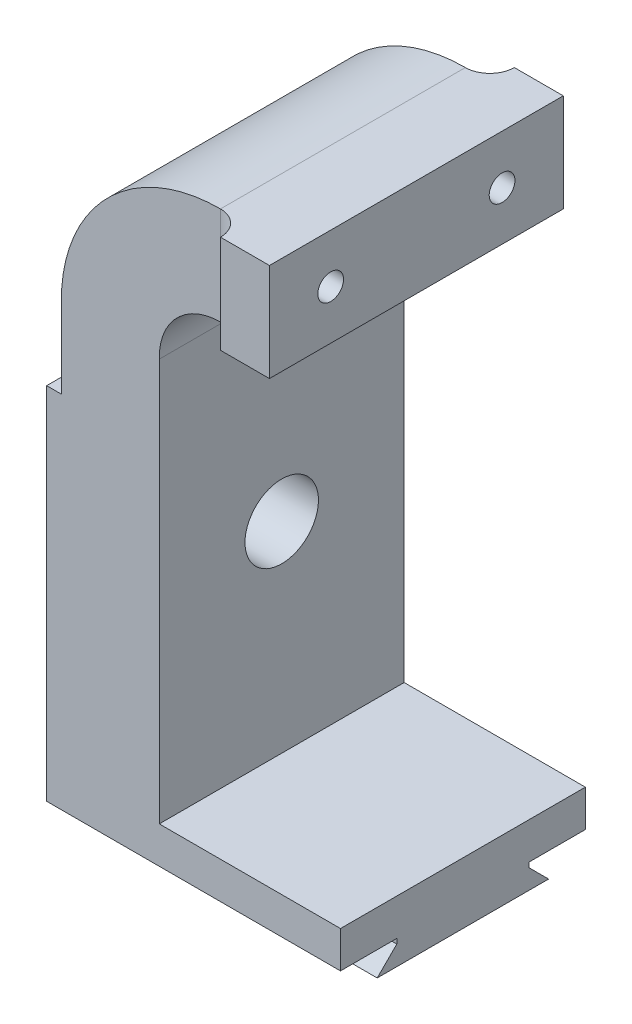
ISO-10303-21;
HEADER;
FILE_DESCRIPTION(('STEP AP214'),'2;1');
FILE_NAME('part.step','',(''),(''),'','','');
FILE_SCHEMA(('AUTOMOTIVE_DESIGN { 1 0 10303 214 1 1 1 1 }'));
ENDSEC;
DATA;
#1=APPLICATION_CONTEXT('core data for automotive mechanical design processes');
#2=APPLICATION_PROTOCOL_DEFINITION('international standard','automotive_design',2000,#1);
#3=PRODUCT_CONTEXT('',#1,'mechanical');
#4=PRODUCT('Part','Part','',(#3));
#5=PRODUCT_RELATED_PRODUCT_CATEGORY('part','',(#4));
#6=PRODUCT_DEFINITION_FORMATION('','',#4);
#7=PRODUCT_DEFINITION_CONTEXT('part definition',#1,'design');
#8=PRODUCT_DEFINITION('design','',#6,#7);
#9=PRODUCT_DEFINITION_SHAPE('','',#8);
#10=(LENGTH_UNIT() NAMED_UNIT(*) SI_UNIT(.MILLI.,.METRE.));
#11=(NAMED_UNIT(*) PLANE_ANGLE_UNIT() SI_UNIT($,.RADIAN.));
#12=(NAMED_UNIT(*) SI_UNIT($,.STERADIAN.) SOLID_ANGLE_UNIT());
#13=UNCERTAINTY_MEASURE_WITH_UNIT(LENGTH_MEASURE(1.E-05),#10,'distance_accuracy_value','');
#14=(GEOMETRIC_REPRESENTATION_CONTEXT(3) GLOBAL_UNCERTAINTY_ASSIGNED_CONTEXT((#13)) GLOBAL_UNIT_ASSIGNED_CONTEXT((#10,
#11,#12)) REPRESENTATION_CONTEXT('',''));
#15=CARTESIAN_POINT('',(0.,0.,0.));
#16=DIRECTION('',(0.,0.,1.));
#17=DIRECTION('',(1.,0.,0.));
#18=AXIS2_PLACEMENT_3D('',#15,#16,#17);
#19=CARTESIAN_POINT('',(-27.5,42.,-50.));
#20=DIRECTION('',(0.,0.,-1.));
#21=DIRECTION('',(-1.,0.,0.));
#22=AXIS2_PLACEMENT_3D('',#19,#20,#21);
#23=PLANE('',#22);
#24=CARTESIAN_POINT('',(-76.5076927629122,222.,-50.));
#25=DIRECTION('',(0.,0.,-1.));
#26=DIRECTION('',(-1.,0.,0.));
#27=AXIS2_PLACEMENT_3D('',#24,#25,#26);
#28=CIRCLE('',#27,65.0000000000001);
#29=CARTESIAN_POINT('',(-76.5076927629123,287.,-50.));
#30=VERTEX_POINT('',#29);
#31=CARTESIAN_POINT('',(-141.5,221.,-50.));
#32=VERTEX_POINT('',#31);
#33=EDGE_CURVE('E471',#30,#32,#28,.F.);
#34=ORIENTED_EDGE('',*,*,#33,.F.);
#35=DIRECTION('',(0.,-1.,0.));
#36=VECTOR('',#35,1.);
#37=CARTESIAN_POINT('',(-76.5076927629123,247.,-50.));
#38=LINE('',#37,#36);
#39=CARTESIAN_POINT('',(-76.5076927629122,247.,-50.));
#40=VERTEX_POINT('',#39);
#41=EDGE_CURVE('E214',#30,#40,#38,.T.);
#42=ORIENTED_EDGE('',*,*,#41,.T.);
#43=CARTESIAN_POINT('',(-76.5076927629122,222.,-50.));
#44=DIRECTION('',(0.,0.,-1.));
#45=DIRECTION('',(-1.,0.,0.));
#46=AXIS2_PLACEMENT_3D('',#43,#44,#45);
#47=CIRCLE('',#46,25.);
#48=CARTESIAN_POINT('',(-101.5,221.379855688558,-50.));
#49=VERTEX_POINT('',#48);
#50=EDGE_CURVE('E474',#49,#40,#47,.T.);
#51=ORIENTED_EDGE('',*,*,#50,.F.);
#52=DIRECTION('',(0.,1.,0.));
#53=VECTOR('',#52,1.);
#54=CARTESIAN_POINT('',(-101.5,221.379855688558,-50.));
#55=LINE('',#54,#53);
#56=CARTESIAN_POINT('',(-101.5,57.,-50.));
#57=VERTEX_POINT('',#56);
#58=EDGE_CURVE('E232',#57,#49,#55,.T.);
#59=ORIENTED_EDGE('',*,*,#58,.F.);
#60=DIRECTION('',(-1.,0.,0.));
#61=VECTOR('',#60,1.);
#62=CARTESIAN_POINT('',(-27.5,57.,-50.));
#63=LINE('',#62,#61);
#64=CARTESIAN_POINT('',(-27.5,57.,-50.));
#65=VERTEX_POINT('',#64);
#66=EDGE_CURVE('E154',#65,#57,#63,.T.);
#67=ORIENTED_EDGE('',*,*,#66,.F.);
#68=DIRECTION('',(0.,-1.,0.));
#69=VECTOR('',#68,1.);
#70=CARTESIAN_POINT('',(-27.5,42.,-50.));
#71=LINE('',#70,#69);
#72=CARTESIAN_POINT('',(-27.5,42.,-50.));
#73=VERTEX_POINT('',#72);
#74=EDGE_CURVE('E160',#65,#73,#71,.T.);
#75=ORIENTED_EDGE('',*,*,#74,.T.);
#76=DIRECTION('',(-1.,0.,0.));
#77=VECTOR('',#76,1.);
#78=CARTESIAN_POINT('',(-27.5,42.,-50.));
#79=LINE('',#78,#77);
#80=CARTESIAN_POINT('',(-147.5,42.,-50.));
#81=VERTEX_POINT('',#80);
#82=EDGE_CURVE('E141',#73,#81,#79,.T.);
#83=ORIENTED_EDGE('',*,*,#82,.T.);
#84=DIRECTION('',(0.,-1.,0.));
#85=VECTOR('',#84,1.);
#86=CARTESIAN_POINT('',(-147.5,42.,-50.));
#87=LINE('',#86,#85);
#88=CARTESIAN_POINT('',(-147.5,189.,-50.));
#89=VERTEX_POINT('',#88);
#90=EDGE_CURVE('E202',#89,#81,#87,.T.);
#91=ORIENTED_EDGE('',*,*,#90,.F.);
#92=DIRECTION('',(-1.,0.,0.));
#93=VECTOR('',#92,1.);
#94=CARTESIAN_POINT('',(-141.5,189.,-50.));
#95=LINE('',#94,#93);
#96=CARTESIAN_POINT('',(-141.5,189.,-50.));
#97=VERTEX_POINT('',#96);
#98=EDGE_CURVE('E269',#97,#89,#95,.T.);
#99=ORIENTED_EDGE('',*,*,#98,.F.);
#100=DIRECTION('',(0.,-1.,0.));
#101=VECTOR('',#100,1.);
#102=CARTESIAN_POINT('',(-141.5,221.,-50.));
#103=LINE('',#102,#101);
#104=EDGE_CURVE('E468',#32,#97,#103,.T.);
#105=ORIENTED_EDGE('',*,*,#104,.F.);
#106=EDGE_LOOP('',(#34,#42,#51,#59,#67,#75,#83,#91,#99,#105));
#107=FACE_BOUND('',#106,.T.);
#108=ADVANCED_FACE('F53',(#107),#23,.T.);
#109=CARTESIAN_POINT('',(-27.5,40.,-27.0000000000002));
#110=DIRECTION('',(0.,0.707106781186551,-0.707106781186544));
#111=DIRECTION('',(0.,0.707106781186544,0.707106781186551));
#112=AXIS2_PLACEMENT_3D('',#109,#110,#111);
#113=PLANE('',#112);
#114=DIRECTION('',(0.,-0.707106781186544,-0.707106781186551));
#115=VECTOR('',#114,1.);
#116=CARTESIAN_POINT('',(-147.5,40.,-27.0000000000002));
#117=LINE('',#116,#115);
#118=CARTESIAN_POINT('',(-147.5,40.,-27.0000000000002));
#119=VERTEX_POINT('',#118);
#120=CARTESIAN_POINT('',(-147.5,32.,-35.0000000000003));
#121=VERTEX_POINT('',#120);
#122=EDGE_CURVE('E177',#119,#121,#117,.T.);
#123=ORIENTED_EDGE('',*,*,#122,.F.);
#124=DIRECTION('',(-1.,0.,0.));
#125=VECTOR('',#124,1.);
#126=CARTESIAN_POINT('',(-27.5,40.,-27.0000000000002));
#127=LINE('',#126,#125);
#128=CARTESIAN_POINT('',(-27.5,40.,-27.0000000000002));
#129=VERTEX_POINT('',#128);
#130=EDGE_CURVE('E78',#129,#119,#127,.T.);
#131=ORIENTED_EDGE('',*,*,#130,.F.);
#132=DIRECTION('',(0.,-0.707106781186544,-0.707106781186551));
#133=VECTOR('',#132,1.);
#134=CARTESIAN_POINT('',(-27.5,40.,-27.0000000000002));
#135=LINE('',#134,#133);
#136=CARTESIAN_POINT('',(-27.5,32.,-35.0000000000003));
#137=VERTEX_POINT('',#136);
#138=EDGE_CURVE('E211',#129,#137,#135,.T.);
#139=ORIENTED_EDGE('',*,*,#138,.T.);
#140=DIRECTION('',(-1.,0.,0.));
#141=VECTOR('',#140,1.);
#142=CARTESIAN_POINT('',(-27.5,32.,-35.0000000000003));
#143=LINE('',#142,#141);
#144=EDGE_CURVE('E117',#137,#121,#143,.T.);
#145=ORIENTED_EDGE('',*,*,#144,.T.);
#146=EDGE_LOOP('',(#123,#131,#139,#145));
#147=FACE_BOUND('',#146,.T.);
#148=ADVANCED_FACE('F314',(#147),#113,.T.);
#149=CARTESIAN_POINT('',(-27.5,42.,-27.0000000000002));
#150=DIRECTION('',(0.,0.,-1.));
#151=DIRECTION('',(-1.,0.,0.));
#152=AXIS2_PLACEMENT_3D('',#149,#150,#151);
#153=PLANE('',#152);
#154=DIRECTION('',(0.,-1.,0.));
#155=VECTOR('',#154,1.);
#156=CARTESIAN_POINT('',(-147.5,42.,-27.0000000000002));
#157=LINE('',#156,#155);
#158=CARTESIAN_POINT('',(-147.5,42.,-27.0000000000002));
#159=VERTEX_POINT('',#158);
#160=EDGE_CURVE('E207',#159,#119,#157,.T.);
#161=ORIENTED_EDGE('',*,*,#160,.F.);
#162=DIRECTION('',(-1.,0.,0.));
#163=VECTOR('',#162,1.);
#164=CARTESIAN_POINT('',(-27.5,42.,-27.0000000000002));
#165=LINE('',#164,#163);
#166=CARTESIAN_POINT('',(-27.5,42.,-27.0000000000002));
#167=VERTEX_POINT('',#166);
#168=EDGE_CURVE('E153',#167,#159,#165,.T.);
#169=ORIENTED_EDGE('',*,*,#168,.F.);
#170=DIRECTION('',(0.,-1.,0.));
#171=VECTOR('',#170,1.);
#172=CARTESIAN_POINT('',(-27.5,42.,-27.0000000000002));
#173=LINE('',#172,#171);
#174=EDGE_CURVE('E162',#167,#129,#173,.T.);
#175=ORIENTED_EDGE('',*,*,#174,.T.);
#176=ORIENTED_EDGE('',*,*,#130,.T.);
#177=EDGE_LOOP('',(#161,#169,#175,#176));
#178=FACE_BOUND('',#177,.T.);
#179=ADVANCED_FACE('F319',(#178),#153,.T.);
#180=CARTESIAN_POINT('',(-27.5,42.,-27.0000000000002));
#181=DIRECTION('',(0.,-1.,0.));
#182=DIRECTION('',(0.,0.,-1.));
#183=AXIS2_PLACEMENT_3D('',#180,#181,#182);
#184=PLANE('',#183);
#185=DIRECTION('',(0.,0.,1.));
#186=VECTOR('',#185,1.);
#187=CARTESIAN_POINT('',(-147.5,42.,-27.0000000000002));
#188=LINE('',#187,#186);
#189=EDGE_CURVE('E147',#81,#159,#188,.T.);
#190=ORIENTED_EDGE('',*,*,#189,.F.);
#191=ORIENTED_EDGE('',*,*,#82,.F.);
#192=DIRECTION('',(0.,0.,1.));
#193=VECTOR('',#192,1.);
#194=CARTESIAN_POINT('',(-27.5,42.,-27.0000000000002));
#195=LINE('',#194,#193);
#196=EDGE_CURVE('E144',#73,#167,#195,.T.);
#197=ORIENTED_EDGE('',*,*,#196,.T.);
#198=ORIENTED_EDGE('',*,*,#168,.T.);
#199=EDGE_LOOP('',(#190,#191,#197,#198));
#200=FACE_BOUND('',#199,.T.);
#201=ADVANCED_FACE('F143',(#200),#184,.T.);
#202=CARTESIAN_POINT('',(-27.5,57.,-50.));
#203=DIRECTION('',(0.,1.,0.));
#204=DIRECTION('',(0.,0.,1.));
#205=AXIS2_PLACEMENT_3D('',#202,#203,#204);
#206=PLANE('',#205);
#207=DIRECTION('',(0.,0.,-1.));
#208=VECTOR('',#207,1.);
#209=CARTESIAN_POINT('',(-101.5,57.,301.196031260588));
#210=LINE('',#209,#208);
#211=CARTESIAN_POINT('',(-101.5,57.,50.));
#212=VERTEX_POINT('',#211);
#213=EDGE_CURVE('E69',#212,#57,#210,.T.);
#214=ORIENTED_EDGE('',*,*,#213,.F.);
#215=DIRECTION('',(-1.,0.,0.));
#216=VECTOR('',#215,1.);
#217=CARTESIAN_POINT('',(-27.5,57.,50.));
#218=LINE('',#217,#216);
#219=CARTESIAN_POINT('',(-27.5,57.,50.));
#220=VERTEX_POINT('',#219);
#221=EDGE_CURVE('E225',#220,#212,#218,.T.);
#222=ORIENTED_EDGE('',*,*,#221,.F.);
#223=DIRECTION('',(0.,0.,-1.));
#224=VECTOR('',#223,1.);
#225=CARTESIAN_POINT('',(-27.5,57.,-50.));
#226=LINE('',#225,#224);
#227=EDGE_CURVE('E168',#220,#65,#226,.T.);
#228=ORIENTED_EDGE('',*,*,#227,.T.);
#229=ORIENTED_EDGE('',*,*,#66,.T.);
#230=EDGE_LOOP('',(#214,#222,#228,#229));
#231=FACE_BOUND('',#230,.T.);
#232=ADVANCED_FACE('F326',(#231),#206,.T.);
#233=CARTESIAN_POINT('',(-27.5,57.,50.));
#234=DIRECTION('',(0.,0.,1.));
#235=DIRECTION('',(1.,0.,0.));
#236=AXIS2_PLACEMENT_3D('',#233,#234,#235);
#237=PLANE('',#236);
#238=CARTESIAN_POINT('',(-76.5076927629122,222.,50.));
#239=DIRECTION('',(0.,0.,1.));
#240=DIRECTION('',(1.,0.,0.));
#241=AXIS2_PLACEMENT_3D('',#238,#239,#240);
#242=CIRCLE('',#241,25.);
#243=CARTESIAN_POINT('',(-101.5,221.379855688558,50.));
#244=VERTEX_POINT('',#243);
#245=CARTESIAN_POINT('',(-76.5076927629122,247.,50.));
#246=VERTEX_POINT('',#245);
#247=EDGE_CURVE('E399',#244,#246,#242,.F.);
#248=ORIENTED_EDGE('',*,*,#247,.T.);
#249=DIRECTION('',(0.,-1.,0.));
#250=VECTOR('',#249,1.);
#251=CARTESIAN_POINT('',(-76.5076927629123,57.,50.));
#252=LINE('',#251,#250);
#253=CARTESIAN_POINT('',(-76.5076927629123,287.,50.));
#254=VERTEX_POINT('',#253);
#255=EDGE_CURVE('E387',#246,#254,#252,.F.);
#256=ORIENTED_EDGE('',*,*,#255,.T.);
#257=CARTESIAN_POINT('',(-76.5076927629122,222.,50.));
#258=DIRECTION('',(0.,0.,1.));
#259=DIRECTION('',(1.,0.,0.));
#260=AXIS2_PLACEMENT_3D('',#257,#258,#259);
#261=CIRCLE('',#260,65.0000000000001);
#262=CARTESIAN_POINT('',(-141.5,221.,50.));
#263=VERTEX_POINT('',#262);
#264=EDGE_CURVE('E404',#254,#263,#261,.T.);
#265=ORIENTED_EDGE('',*,*,#264,.T.);
#266=DIRECTION('',(0.,-1.,0.));
#267=VECTOR('',#266,1.);
#268=CARTESIAN_POINT('',(-141.5,221.,50.));
#269=LINE('',#268,#267);
#270=CARTESIAN_POINT('',(-141.5,189.,50.));
#271=VERTEX_POINT('',#270);
#272=EDGE_CURVE('E182',#263,#271,#269,.T.);
#273=ORIENTED_EDGE('',*,*,#272,.T.);
#274=DIRECTION('',(-1.,0.,0.));
#275=VECTOR('',#274,1.);
#276=CARTESIAN_POINT('',(-141.5,189.,50.));
#277=LINE('',#276,#275);
#278=CARTESIAN_POINT('',(-147.5,189.,50.));
#279=VERTEX_POINT('',#278);
#280=EDGE_CURVE('E237',#271,#279,#277,.T.);
#281=ORIENTED_EDGE('',*,*,#280,.T.);
#282=DIRECTION('',(0.,1.,0.));
#283=VECTOR('',#282,1.);
#284=CARTESIAN_POINT('',(-147.5,57.,50.));
#285=LINE('',#284,#283);
#286=CARTESIAN_POINT('',(-147.5,42.,50.));
#287=VERTEX_POINT('',#286);
#288=EDGE_CURVE('E198',#287,#279,#285,.T.);
#289=ORIENTED_EDGE('',*,*,#288,.F.);
#290=DIRECTION('',(-1.,0.,0.));
#291=VECTOR('',#290,1.);
#292=CARTESIAN_POINT('',(-27.5,42.,50.));
#293=LINE('',#292,#291);
#294=CARTESIAN_POINT('',(-27.5,42.,50.));
#295=VERTEX_POINT('',#294);
#296=EDGE_CURVE('E295',#295,#287,#293,.T.);
#297=ORIENTED_EDGE('',*,*,#296,.F.);
#298=DIRECTION('',(0.,1.,0.));
#299=VECTOR('',#298,1.);
#300=CARTESIAN_POINT('',(-27.5,57.,50.));
#301=LINE('',#300,#299);
#302=EDGE_CURVE('E171',#295,#220,#301,.T.);
#303=ORIENTED_EDGE('',*,*,#302,.T.);
#304=ORIENTED_EDGE('',*,*,#221,.T.);
#305=DIRECTION('',(0.,1.,0.));
#306=VECTOR('',#305,1.);
#307=CARTESIAN_POINT('',(-101.5,221.379855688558,50.));
#308=LINE('',#307,#306);
#309=EDGE_CURVE('E397',#212,#244,#308,.T.);
#310=ORIENTED_EDGE('',*,*,#309,.T.);
#311=EDGE_LOOP('',(#248,#256,#265,#273,#281,#289,#297,#303,#304,#310));
#312=FACE_BOUND('',#311,.T.);
#313=ADVANCED_FACE('F291',(#312),#237,.T.);
#314=CARTESIAN_POINT('',(-27.5,42.,50.));
#315=DIRECTION('',(0.,-1.,0.));
#316=DIRECTION('',(0.,0.,-1.));
#317=AXIS2_PLACEMENT_3D('',#314,#315,#316);
#318=PLANE('',#317);
#319=DIRECTION('',(0.,0.,1.));
#320=VECTOR('',#319,1.);
#321=CARTESIAN_POINT('',(-147.5,42.,50.));
#322=LINE('',#321,#320);
#323=CARTESIAN_POINT('',(-147.5,42.,27.0000000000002));
#324=VERTEX_POINT('',#323);
#325=EDGE_CURVE('E194',#324,#287,#322,.T.);
#326=ORIENTED_EDGE('',*,*,#325,.F.);
#327=DIRECTION('',(-1.,0.,0.));
#328=VECTOR('',#327,1.);
#329=CARTESIAN_POINT('',(-27.5,42.,27.0000000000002));
#330=LINE('',#329,#328);
#331=CARTESIAN_POINT('',(-27.5,42.,27.0000000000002));
#332=VERTEX_POINT('',#331);
#333=EDGE_CURVE('E301',#332,#324,#330,.T.);
#334=ORIENTED_EDGE('',*,*,#333,.F.);
#335=DIRECTION('',(0.,0.,1.));
#336=VECTOR('',#335,1.);
#337=CARTESIAN_POINT('',(-27.5,42.,50.));
#338=LINE('',#337,#336);
#339=EDGE_CURVE('E283',#332,#295,#338,.T.);
#340=ORIENTED_EDGE('',*,*,#339,.T.);
#341=ORIENTED_EDGE('',*,*,#296,.T.);
#342=EDGE_LOOP('',(#326,#334,#340,#341));
#343=FACE_BOUND('',#342,.T.);
#344=ADVANCED_FACE('F300',(#343),#318,.T.);
#345=CARTESIAN_POINT('',(-27.5,40.,27.0000000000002));
#346=DIRECTION('',(0.,0.,1.));
#347=DIRECTION('',(0.,-1.,0.));
#348=AXIS2_PLACEMENT_3D('',#345,#346,#347);
#349=PLANE('',#348);
#350=DIRECTION('',(0.,1.,0.));
#351=VECTOR('',#350,1.);
#352=CARTESIAN_POINT('',(-147.5,40.,27.0000000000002));
#353=LINE('',#352,#351);
#354=CARTESIAN_POINT('',(-147.5,40.,27.0000000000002));
#355=VERTEX_POINT('',#354);
#356=EDGE_CURVE('E190',#355,#324,#353,.T.);
#357=ORIENTED_EDGE('',*,*,#356,.F.);
#358=DIRECTION('',(-1.,0.,0.));
#359=VECTOR('',#358,1.);
#360=CARTESIAN_POINT('',(-27.5,40.,27.0000000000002));
#361=LINE('',#360,#359);
#362=CARTESIAN_POINT('',(-27.5,40.,27.0000000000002));
#363=VERTEX_POINT('',#362);
#364=EDGE_CURVE('E305',#363,#355,#361,.T.);
#365=ORIENTED_EDGE('',*,*,#364,.F.);
#366=DIRECTION('',(0.,1.,0.));
#367=VECTOR('',#366,1.);
#368=CARTESIAN_POINT('',(-27.5,40.,27.0000000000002));
#369=LINE('',#368,#367);
#370=EDGE_CURVE('E279',#363,#332,#369,.T.);
#371=ORIENTED_EDGE('',*,*,#370,.T.);
#372=ORIENTED_EDGE('',*,*,#333,.T.);
#373=EDGE_LOOP('',(#357,#365,#371,#372));
#374=FACE_BOUND('',#373,.T.);
#375=ADVANCED_FACE('F342',(#374),#349,.T.);
#376=CARTESIAN_POINT('',(-27.5,32.,35.0000000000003));
#377=DIRECTION('',(0.,0.707106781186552,0.707106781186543));
#378=DIRECTION('',(0.,-0.707106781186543,0.707106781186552));
#379=AXIS2_PLACEMENT_3D('',#376,#377,#378);
#380=PLANE('',#379);
#381=DIRECTION('',(0.,0.707106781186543,-0.707106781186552));
#382=VECTOR('',#381,1.);
#383=CARTESIAN_POINT('',(-147.5,32.,35.0000000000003));
#384=LINE('',#383,#382);
#385=CARTESIAN_POINT('',(-147.5,32.,35.0000000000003));
#386=VERTEX_POINT('',#385);
#387=EDGE_CURVE('E186',#386,#355,#384,.T.);
#388=ORIENTED_EDGE('',*,*,#387,.F.);
#389=DIRECTION('',(-1.,0.,0.));
#390=VECTOR('',#389,1.);
#391=CARTESIAN_POINT('',(-27.5,32.,35.0000000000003));
#392=LINE('',#391,#390);
#393=CARTESIAN_POINT('',(-27.5,32.,35.0000000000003));
#394=VERTEX_POINT('',#393);
#395=EDGE_CURVE('E309',#394,#386,#392,.T.);
#396=ORIENTED_EDGE('',*,*,#395,.F.);
#397=DIRECTION('',(0.,0.707106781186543,-0.707106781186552));
#398=VECTOR('',#397,1.);
#399=CARTESIAN_POINT('',(-27.5,32.,35.0000000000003));
#400=LINE('',#399,#398);
#401=EDGE_CURVE('E275',#394,#363,#400,.T.);
#402=ORIENTED_EDGE('',*,*,#401,.T.);
#403=ORIENTED_EDGE('',*,*,#364,.T.);
#404=EDGE_LOOP('',(#388,#396,#402,#403));
#405=FACE_BOUND('',#404,.T.);
#406=ADVANCED_FACE('F345',(#405),#380,.T.);
#407=CARTESIAN_POINT('',(-27.5,32.,-35.0000000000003));
#408=DIRECTION('',(0.,-1.,0.));
#409=DIRECTION('',(0.,0.,-1.));
#410=AXIS2_PLACEMENT_3D('',#407,#408,#409);
#411=PLANE('',#410);
#412=DIRECTION('',(0.,0.,1.));
#413=VECTOR('',#412,1.);
#414=CARTESIAN_POINT('',(-147.5,32.,-35.0000000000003));
#415=LINE('',#414,#413);
#416=EDGE_CURVE('E181',#121,#386,#415,.T.);
#417=ORIENTED_EDGE('',*,*,#416,.F.);
#418=ORIENTED_EDGE('',*,*,#144,.F.);
#419=DIRECTION('',(0.,0.,1.));
#420=VECTOR('',#419,1.);
#421=CARTESIAN_POINT('',(-27.5,32.,-35.0000000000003));
#422=LINE('',#421,#420);
#423=EDGE_CURVE('E272',#137,#394,#422,.T.);
#424=ORIENTED_EDGE('',*,*,#423,.T.);
#425=ORIENTED_EDGE('',*,*,#395,.T.);
#426=EDGE_LOOP('',(#417,#418,#424,#425));
#427=FACE_BOUND('',#426,.T.);
#428=ADVANCED_FACE('F315',(#427),#411,.T.);
#429=CARTESIAN_POINT('',(-27.5,0.,0.));
#430=DIRECTION('',(1.,0.,0.));
#431=DIRECTION('',(0.,0.,-1.));
#432=AXIS2_PLACEMENT_3D('',#429,#430,#431);
#433=PLANE('',#432);
#434=ORIENTED_EDGE('',*,*,#138,.F.);
#435=ORIENTED_EDGE('',*,*,#174,.F.);
#436=ORIENTED_EDGE('',*,*,#196,.F.);
#437=ORIENTED_EDGE('',*,*,#74,.F.);
#438=ORIENTED_EDGE('',*,*,#227,.F.);
#439=ORIENTED_EDGE('',*,*,#302,.F.);
#440=ORIENTED_EDGE('',*,*,#339,.F.);
#441=ORIENTED_EDGE('',*,*,#370,.F.);
#442=ORIENTED_EDGE('',*,*,#401,.F.);
#443=ORIENTED_EDGE('',*,*,#423,.F.);
#444=EDGE_LOOP('',(#434,#435,#436,#437,#438,#439,#440,#441,#442,#443));
#445=FACE_BOUND('',#444,.T.);
#446=ADVANCED_FACE('F158',(#445),#433,.T.);
#447=CARTESIAN_POINT('',(-147.5,0.,0.));
#448=DIRECTION('',(1.,0.,0.));
#449=DIRECTION('',(0.,0.,-1.));
#450=AXIS2_PLACEMENT_3D('',#447,#448,#449);
#451=PLANE('',#450);
#452=CARTESIAN_POINT('',(-147.5,139.,0.));
#453=DIRECTION('',(1.,0.,0.));
#454=DIRECTION('',(0.,1.,0.));
#455=AXIS2_PLACEMENT_3D('',#452,#453,#454);
#456=CIRCLE('',#455,15.);
#457=CARTESIAN_POINT('',(-147.5,154.,0.));
#458=VERTEX_POINT('',#457);
#459=EDGE_CURVE('E523',#458,#458,#456,.T.);
#460=ORIENTED_EDGE('',*,*,#459,.T.);
#461=EDGE_LOOP('',(#460));
#462=FACE_BOUND('',#461,.T.);
#463=ORIENTED_EDGE('',*,*,#122,.T.);
#464=ORIENTED_EDGE('',*,*,#416,.T.);
#465=ORIENTED_EDGE('',*,*,#387,.T.);
#466=ORIENTED_EDGE('',*,*,#356,.T.);
#467=ORIENTED_EDGE('',*,*,#325,.T.);
#468=ORIENTED_EDGE('',*,*,#288,.T.);
#469=DIRECTION('',(0.,0.,-1.));
#470=VECTOR('',#469,1.);
#471=CARTESIAN_POINT('',(-147.5,189.,301.196031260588));
#472=LINE('',#471,#470);
#473=EDGE_CURVE('E231',#279,#89,#472,.T.);
#474=ORIENTED_EDGE('',*,*,#473,.T.);
#475=ORIENTED_EDGE('',*,*,#90,.T.);
#476=ORIENTED_EDGE('',*,*,#189,.T.);
#477=ORIENTED_EDGE('',*,*,#160,.T.);
#478=EDGE_LOOP('',(#463,#464,#465,#466,#467,#468,#474,#475,#476,#477));
#479=FACE_BOUND('',#478,.T.);
#480=ADVANCED_FACE('F318',(#462,#479),#451,.F.);
#481=CARTESIAN_POINT('',(-101.5,221.379855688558,301.196031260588));
#482=DIRECTION('',(-1.,0.,0.));
#483=DIRECTION('',(0.,-1.,0.));
#484=AXIS2_PLACEMENT_3D('',#481,#482,#483);
#485=PLANE('',#484);
#486=CARTESIAN_POINT('',(-101.5,139.,0.));
#487=DIRECTION('',(1.,0.,0.));
#488=DIRECTION('',(0.,1.,0.));
#489=AXIS2_PLACEMENT_3D('',#486,#487,#488);
#490=CIRCLE('',#489,15.);
#491=CARTESIAN_POINT('',(-101.5,154.,0.));
#492=VERTEX_POINT('',#491);
#493=EDGE_CURVE('E527',#492,#492,#490,.T.);
#494=ORIENTED_EDGE('',*,*,#493,.F.);
#495=EDGE_LOOP('',(#494));
#496=FACE_BOUND('',#495,.T.);
#497=ORIENTED_EDGE('',*,*,#309,.F.);
#498=ORIENTED_EDGE('',*,*,#213,.T.);
#499=ORIENTED_EDGE('',*,*,#58,.T.);
#500=DIRECTION('',(0.,0.,-1.));
#501=VECTOR('',#500,1.);
#502=CARTESIAN_POINT('',(-101.5,221.379855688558,301.196031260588));
#503=LINE('',#502,#501);
#504=EDGE_CURVE('E230',#244,#49,#503,.T.);
#505=ORIENTED_EDGE('',*,*,#504,.F.);
#506=EDGE_LOOP('',(#497,#498,#499,#505));
#507=FACE_BOUND('',#506,.T.);
#508=ADVANCED_FACE('F487',(#496,#507),#485,.F.);
#509=CARTESIAN_POINT('',(-76.5076927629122,222.,301.196031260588));
#510=DIRECTION('',(0.,0.,-1.));
#511=DIRECTION('',(-1.,0.,0.));
#512=AXIS2_PLACEMENT_3D('',#509,#510,#511);
#513=CYLINDRICAL_SURFACE('',#512,25.);
#514=ORIENTED_EDGE('',*,*,#247,.F.);
#515=ORIENTED_EDGE('',*,*,#504,.T.);
#516=ORIENTED_EDGE('',*,*,#50,.T.);
#517=DIRECTION('',(0.,0.,-1.));
#518=VECTOR('',#517,1.);
#519=CARTESIAN_POINT('',(-76.5076927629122,247.,301.196031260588));
#520=LINE('',#519,#518);
#521=EDGE_CURVE('E242',#246,#40,#520,.T.);
#522=ORIENTED_EDGE('',*,*,#521,.F.);
#523=EDGE_LOOP('',(#514,#515,#516,#522));
#524=FACE_BOUND('',#523,.T.);
#525=ADVANCED_FACE('F503',(#524),#513,.F.);
#526=CARTESIAN_POINT('',(-46.5076927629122,247.,301.196031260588));
#527=DIRECTION('',(0.,1.,0.));
#528=DIRECTION('',(-1.,0.,0.));
#529=AXIS2_PLACEMENT_3D('',#526,#527,#528);
#530=PLANE('',#529);
#531=DIRECTION('',(1.,0.,0.));
#532=VECTOR('',#531,1.);
#533=CARTESIAN_POINT('',(-46.5076927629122,247.,60.));
#534=LINE('',#533,#532);
#535=CARTESIAN_POINT('',(-66.5076927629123,247.,60.));
#536=VERTEX_POINT('',#535);
#537=CARTESIAN_POINT('',(-46.5076927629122,247.,60.));
#538=VERTEX_POINT('',#537);
#539=EDGE_CURVE('E456',#536,#538,#534,.T.);
#540=ORIENTED_EDGE('',*,*,#539,.F.);
#541=CARTESIAN_POINT('',(-76.5076927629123,247.,60.));
#542=DIRECTION('',(0.,1.,0.));
#543=DIRECTION('',(-1.,0.,0.));
#544=AXIS2_PLACEMENT_3D('',#541,#542,#543);
#545=CIRCLE('',#544,10.);
#546=EDGE_CURVE('E62',#536,#246,#545,.T.);
#547=ORIENTED_EDGE('',*,*,#546,.T.);
#548=ORIENTED_EDGE('',*,*,#521,.T.);
#549=CARTESIAN_POINT('',(-76.5076927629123,247.,-60.));
#550=DIRECTION('',(0.,1.,0.));
#551=DIRECTION('',(-1.,0.,0.));
#552=AXIS2_PLACEMENT_3D('',#549,#550,#551);
#553=CIRCLE('',#552,10.);
#554=CARTESIAN_POINT('',(-66.5076927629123,247.,-60.));
#555=VERTEX_POINT('',#554);
#556=EDGE_CURVE('E381',#40,#555,#553,.T.);
#557=ORIENTED_EDGE('',*,*,#556,.T.);
#558=DIRECTION('',(1.,0.,0.));
#559=VECTOR('',#558,1.);
#560=CARTESIAN_POINT('',(-46.5076927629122,247.,-60.));
#561=LINE('',#560,#559);
#562=CARTESIAN_POINT('',(-46.5076927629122,247.,-60.));
#563=VERTEX_POINT('',#562);
#564=EDGE_CURVE('E532',#555,#563,#561,.T.);
#565=ORIENTED_EDGE('',*,*,#564,.T.);
#566=DIRECTION('',(0.,0.,-1.));
#567=VECTOR('',#566,1.);
#568=CARTESIAN_POINT('',(-46.5076927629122,247.,301.196031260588));
#569=LINE('',#568,#567);
#570=EDGE_CURVE('E246',#538,#563,#569,.T.);
#571=ORIENTED_EDGE('',*,*,#570,.F.);
#572=EDGE_LOOP('',(#540,#547,#548,#557,#565,#571));
#573=FACE_BOUND('',#572,.T.);
#574=ADVANCED_FACE('F502',(#573),#530,.F.);
#575=CARTESIAN_POINT('',(-46.5076927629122,287.,301.196031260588));
#576=DIRECTION('',(-1.,0.,0.));
#577=DIRECTION('',(0.,-1.,0.));
#578=AXIS2_PLACEMENT_3D('',#575,#576,#577);
#579=PLANE('',#578);
#580=CARTESIAN_POINT('',(-46.5076927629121,267.,35.));
#581=DIRECTION('',(1.,0.,0.));
#582=DIRECTION('',(0.,0.,-1.));
#583=AXIS2_PLACEMENT_3D('',#580,#581,#582);
#584=CIRCLE('',#583,5.24999999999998);
#585=CARTESIAN_POINT('',(-46.5076927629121,267.,29.75));
#586=VERTEX_POINT('',#585);
#587=EDGE_CURVE('E577',#586,#586,#584,.T.);
#588=ORIENTED_EDGE('',*,*,#587,.F.);
#589=EDGE_LOOP('',(#588));
#590=FACE_BOUND('',#589,.T.);
#591=CARTESIAN_POINT('',(-46.5076927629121,267.,-35.));
#592=DIRECTION('',(1.,0.,0.));
#593=DIRECTION('',(0.,0.,-1.));
#594=AXIS2_PLACEMENT_3D('',#591,#592,#593);
#595=CIRCLE('',#594,5.24999999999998);
#596=CARTESIAN_POINT('',(-46.5076927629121,267.,-40.25));
#597=VERTEX_POINT('',#596);
#598=EDGE_CURVE('E576',#597,#597,#595,.T.);
#599=ORIENTED_EDGE('',*,*,#598,.F.);
#600=EDGE_LOOP('',(#599));
#601=FACE_BOUND('',#600,.T.);
#602=DIRECTION('',(0.,0.,-1.));
#603=VECTOR('',#602,1.);
#604=CARTESIAN_POINT('',(-46.5076927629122,287.,301.196031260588));
#605=LINE('',#604,#603);
#606=CARTESIAN_POINT('',(-46.5076927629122,287.,60.));
#607=VERTEX_POINT('',#606);
#608=CARTESIAN_POINT('',(-46.5076927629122,287.,-60.));
#609=VERTEX_POINT('',#608);
#610=EDGE_CURVE('E250',#607,#609,#605,.T.);
#611=ORIENTED_EDGE('',*,*,#610,.F.);
#612=DIRECTION('',(0.,1.,0.));
#613=VECTOR('',#612,1.);
#614=CARTESIAN_POINT('',(-46.5076927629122,287.,60.));
#615=LINE('',#614,#613);
#616=EDGE_CURVE('E462',#538,#607,#615,.T.);
#617=ORIENTED_EDGE('',*,*,#616,.F.);
#618=ORIENTED_EDGE('',*,*,#570,.T.);
#619=DIRECTION('',(0.,1.,0.));
#620=VECTOR('',#619,1.);
#621=CARTESIAN_POINT('',(-46.5076927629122,287.,-60.));
#622=LINE('',#621,#620);
#623=EDGE_CURVE('E526',#563,#609,#622,.T.);
#624=ORIENTED_EDGE('',*,*,#623,.T.);
#625=EDGE_LOOP('',(#611,#617,#618,#624));
#626=FACE_BOUND('',#625,.T.);
#627=ADVANCED_FACE('F509',(#590,#601,#626),#579,.F.);
#628=CARTESIAN_POINT('',(-76.5076927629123,287.,301.196031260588));
#629=DIRECTION('',(0.,-1.,0.));
#630=DIRECTION('',(0.,0.,-1.));
#631=AXIS2_PLACEMENT_3D('',#628,#629,#630);
#632=PLANE('',#631);
#633=DIRECTION('',(0.,0.,-1.));
#634=VECTOR('',#633,1.);
#635=CARTESIAN_POINT('',(-76.5076927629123,287.,301.196031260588));
#636=LINE('',#635,#634);
#637=EDGE_CURVE('E254',#254,#30,#636,.T.);
#638=ORIENTED_EDGE('',*,*,#637,.F.);
#639=CARTESIAN_POINT('',(-76.5076927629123,287.,60.));
#640=DIRECTION('',(0.,-1.,0.));
#641=DIRECTION('',(0.,0.,-1.));
#642=AXIS2_PLACEMENT_3D('',#639,#640,#641);
#643=CIRCLE('',#642,10.);
#644=CARTESIAN_POINT('',(-66.5076927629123,287.,60.));
#645=VERTEX_POINT('',#644);
#646=EDGE_CURVE('E11',#254,#645,#643,.T.);
#647=ORIENTED_EDGE('',*,*,#646,.T.);
#648=DIRECTION('',(-1.,0.,0.));
#649=VECTOR('',#648,1.);
#650=CARTESIAN_POINT('',(-46.5076927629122,287.,60.));
#651=LINE('',#650,#649);
#652=EDGE_CURVE('E457',#607,#645,#651,.T.);
#653=ORIENTED_EDGE('',*,*,#652,.F.);
#654=ORIENTED_EDGE('',*,*,#610,.T.);
#655=DIRECTION('',(-1.,0.,0.));
#656=VECTOR('',#655,1.);
#657=CARTESIAN_POINT('',(-46.5076927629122,287.,-60.));
#658=LINE('',#657,#656);
#659=CARTESIAN_POINT('',(-66.5076927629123,287.,-60.));
#660=VERTEX_POINT('',#659);
#661=EDGE_CURVE('E544',#609,#660,#658,.T.);
#662=ORIENTED_EDGE('',*,*,#661,.T.);
#663=CARTESIAN_POINT('',(-76.5076927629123,287.,-60.));
#664=DIRECTION('',(0.,-1.,0.));
#665=DIRECTION('',(0.,0.,-1.));
#666=AXIS2_PLACEMENT_3D('',#663,#664,#665);
#667=CIRCLE('',#666,10.);
#668=EDGE_CURVE('E368',#660,#30,#667,.T.);
#669=ORIENTED_EDGE('',*,*,#668,.T.);
#670=EDGE_LOOP('',(#638,#647,#653,#654,#662,#669));
#671=FACE_BOUND('',#670,.T.);
#672=ADVANCED_FACE('F442',(#671),#632,.F.);
#673=CARTESIAN_POINT('',(-76.5076927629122,222.,301.196031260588));
#674=DIRECTION('',(0.,0.,-1.));
#675=DIRECTION('',(-1.,0.,0.));
#676=AXIS2_PLACEMENT_3D('',#673,#674,#675);
#677=CYLINDRICAL_SURFACE('',#676,65.0000000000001);
#678=ORIENTED_EDGE('',*,*,#264,.F.);
#679=ORIENTED_EDGE('',*,*,#637,.T.);
#680=ORIENTED_EDGE('',*,*,#33,.T.);
#681=DIRECTION('',(0.,0.,-1.));
#682=VECTOR('',#681,1.);
#683=CARTESIAN_POINT('',(-141.5,221.,301.196031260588));
#684=LINE('',#683,#682);
#685=EDGE_CURVE('E258',#263,#32,#684,.T.);
#686=ORIENTED_EDGE('',*,*,#685,.F.);
#687=EDGE_LOOP('',(#678,#679,#680,#686));
#688=FACE_BOUND('',#687,.T.);
#689=ADVANCED_FACE('F438',(#688),#677,.T.);
#690=CARTESIAN_POINT('',(-141.5,221.,301.196031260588));
#691=DIRECTION('',(1.,0.,0.));
#692=DIRECTION('',(0.,0.,-1.));
#693=AXIS2_PLACEMENT_3D('',#690,#691,#692);
#694=PLANE('',#693);
#695=ORIENTED_EDGE('',*,*,#272,.F.);
#696=ORIENTED_EDGE('',*,*,#685,.T.);
#697=ORIENTED_EDGE('',*,*,#104,.T.);
#698=DIRECTION('',(0.,0.,-1.));
#699=VECTOR('',#698,1.);
#700=CARTESIAN_POINT('',(-141.5,189.,301.196031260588));
#701=LINE('',#700,#699);
#702=EDGE_CURVE('E262',#271,#97,#701,.T.);
#703=ORIENTED_EDGE('',*,*,#702,.F.);
#704=EDGE_LOOP('',(#695,#696,#697,#703));
#705=FACE_BOUND('',#704,.T.);
#706=ADVANCED_FACE('F609',(#705),#694,.F.);
#707=CARTESIAN_POINT('',(-141.5,189.,301.196031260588));
#708=DIRECTION('',(0.,-1.,0.));
#709=DIRECTION('',(0.,0.,-1.));
#710=AXIS2_PLACEMENT_3D('',#707,#708,#709);
#711=PLANE('',#710);
#712=ORIENTED_EDGE('',*,*,#280,.F.);
#713=ORIENTED_EDGE('',*,*,#702,.T.);
#714=ORIENTED_EDGE('',*,*,#98,.T.);
#715=ORIENTED_EDGE('',*,*,#473,.F.);
#716=EDGE_LOOP('',(#712,#713,#714,#715));
#717=FACE_BOUND('',#716,.T.);
#718=ADVANCED_FACE('F413',(#717),#711,.F.);
#719=CARTESIAN_POINT('',(0.,0.,60.));
#720=DIRECTION('',(0.,0.,-1.));
#721=DIRECTION('',(-1.,0.,0.));
#722=AXIS2_PLACEMENT_3D('',#719,#720,#721);
#723=PLANE('',#722);
#724=ORIENTED_EDGE('',*,*,#616,.T.);
#725=ORIENTED_EDGE('',*,*,#652,.T.);
#726=DIRECTION('',(0.,-1.,0.));
#727=VECTOR('',#726,1.);
#728=CARTESIAN_POINT('',(-66.5076927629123,287.,60.));
#729=LINE('',#728,#727);
#730=EDGE_CURVE('E448',#645,#536,#729,.T.);
#731=ORIENTED_EDGE('',*,*,#730,.T.);
#732=ORIENTED_EDGE('',*,*,#539,.T.);
#733=EDGE_LOOP('',(#724,#725,#731,#732));
#734=FACE_BOUND('',#733,.T.);
#735=ADVANCED_FACE('F360',(#734),#723,.F.);
#736=CARTESIAN_POINT('',(0.,0.,-60.));
#737=DIRECTION('',(0.,0.,1.));
#738=DIRECTION('',(-1.,0.,0.));
#739=AXIS2_PLACEMENT_3D('',#736,#737,#738);
#740=PLANE('',#739);
#741=ORIENTED_EDGE('',*,*,#623,.F.);
#742=ORIENTED_EDGE('',*,*,#564,.F.);
#743=DIRECTION('',(0.,-1.,0.));
#744=VECTOR('',#743,1.);
#745=CARTESIAN_POINT('',(-66.5076927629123,287.,-60.));
#746=LINE('',#745,#744);
#747=EDGE_CURVE('E372',#660,#555,#746,.T.);
#748=ORIENTED_EDGE('',*,*,#747,.F.);
#749=ORIENTED_EDGE('',*,*,#661,.F.);
#750=EDGE_LOOP('',(#741,#742,#748,#749));
#751=FACE_BOUND('',#750,.T.);
#752=ADVANCED_FACE('F352',(#751),#740,.F.);
#753=CARTESIAN_POINT('',(-76.5076927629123,42.,-60.));
#754=DIRECTION('',(0.,1.,0.));
#755=DIRECTION('',(0.,0.,1.));
#756=AXIS2_PLACEMENT_3D('',#753,#754,#755);
#757=CYLINDRICAL_SURFACE('',#756,10.);
#758=ORIENTED_EDGE('',*,*,#668,.F.);
#759=ORIENTED_EDGE('',*,*,#747,.T.);
#760=ORIENTED_EDGE('',*,*,#556,.F.);
#761=ORIENTED_EDGE('',*,*,#41,.F.);
#762=EDGE_LOOP('',(#758,#759,#760,#761));
#763=FACE_BOUND('',#762,.T.);
#764=ADVANCED_FACE('F350',(#763),#757,.F.);
#765=CARTESIAN_POINT('',(-76.5076927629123,287.,60.));
#766=DIRECTION('',(0.,-1.,0.));
#767=DIRECTION('',(0.,0.,-1.));
#768=AXIS2_PLACEMENT_3D('',#765,#766,#767);
#769=CYLINDRICAL_SURFACE('',#768,10.);
#770=ORIENTED_EDGE('',*,*,#646,.F.);
#771=ORIENTED_EDGE('',*,*,#255,.F.);
#772=ORIENTED_EDGE('',*,*,#546,.F.);
#773=ORIENTED_EDGE('',*,*,#730,.F.);
#774=EDGE_LOOP('',(#770,#771,#772,#773));
#775=FACE_BOUND('',#774,.T.);
#776=ADVANCED_FACE('F55',(#775),#769,.F.);
#777=CARTESIAN_POINT('',(-147.5,139.,0.));
#778=DIRECTION('',(1.,0.,0.));
#779=DIRECTION('',(0.,1.,0.));
#780=AXIS2_PLACEMENT_3D('',#777,#778,#779);
#781=CYLINDRICAL_SURFACE('',#780,15.);
#782=CARTESIAN_POINT('',(-147.5,154.,0.));
#783=CARTESIAN_POINT('',(-147.020833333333,154.,0.));
#784=CARTESIAN_POINT('',(-146.541666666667,154.,0.));
#785=CARTESIAN_POINT('',(-145.583333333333,154.,0.));
#786=CARTESIAN_POINT('',(-145.104166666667,154.,0.));
#787=CARTESIAN_POINT('',(-144.145833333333,154.,0.));
#788=CARTESIAN_POINT('',(-143.666666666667,154.,0.));
#789=CARTESIAN_POINT('',(-142.708333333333,154.,0.));
#790=CARTESIAN_POINT('',(-142.229166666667,154.,0.));
#791=CARTESIAN_POINT('',(-141.270833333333,154.,0.));
#792=CARTESIAN_POINT('',(-140.791666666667,154.,0.));
#793=CARTESIAN_POINT('',(-139.833333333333,154.,0.));
#794=CARTESIAN_POINT('',(-139.354166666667,154.,0.));
#795=CARTESIAN_POINT('',(-138.395833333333,154.,0.));
#796=CARTESIAN_POINT('',(-137.916666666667,154.,0.));
#797=CARTESIAN_POINT('',(-136.958333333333,154.,0.));
#798=CARTESIAN_POINT('',(-136.479166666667,154.,0.));
#799=CARTESIAN_POINT('',(-135.520833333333,154.,0.));
#800=CARTESIAN_POINT('',(-135.041666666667,154.,0.));
#801=CARTESIAN_POINT('',(-134.083333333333,154.,0.));
#802=CARTESIAN_POINT('',(-133.604166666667,154.,0.));
#803=CARTESIAN_POINT('',(-132.645833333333,154.,0.));
#804=CARTESIAN_POINT('',(-132.166666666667,154.,0.));
#805=CARTESIAN_POINT('',(-131.208333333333,154.,0.));
#806=CARTESIAN_POINT('',(-130.729166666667,154.,0.));
#807=CARTESIAN_POINT('',(-129.770833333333,154.,0.));
#808=CARTESIAN_POINT('',(-129.291666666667,154.,0.));
#809=CARTESIAN_POINT('',(-128.333333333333,154.,0.));
#810=CARTESIAN_POINT('',(-127.854166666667,154.,0.));
#811=CARTESIAN_POINT('',(-126.895833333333,154.,0.));
#812=CARTESIAN_POINT('',(-126.416666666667,154.,0.));
#813=CARTESIAN_POINT('',(-125.458333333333,154.,0.));
#814=CARTESIAN_POINT('',(-124.979166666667,154.,0.));
#815=CARTESIAN_POINT('',(-124.020833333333,154.,0.));
#816=CARTESIAN_POINT('',(-123.541666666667,154.,0.));
#817=CARTESIAN_POINT('',(-122.583333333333,154.,0.));
#818=CARTESIAN_POINT('',(-122.104166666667,154.,0.));
#819=CARTESIAN_POINT('',(-121.145833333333,154.,0.));
#820=CARTESIAN_POINT('',(-120.666666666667,154.,0.));
#821=CARTESIAN_POINT('',(-119.708333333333,154.,0.));
#822=CARTESIAN_POINT('',(-119.229166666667,154.,0.));
#823=CARTESIAN_POINT('',(-118.270833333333,154.,0.));
#824=CARTESIAN_POINT('',(-117.791666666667,154.,0.));
#825=CARTESIAN_POINT('',(-116.833333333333,154.,0.));
#826=CARTESIAN_POINT('',(-116.354166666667,154.,0.));
#827=CARTESIAN_POINT('',(-115.395833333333,154.,0.));
#828=CARTESIAN_POINT('',(-114.916666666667,154.,0.));
#829=CARTESIAN_POINT('',(-113.958333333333,154.,0.));
#830=CARTESIAN_POINT('',(-113.479166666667,154.,0.));
#831=CARTESIAN_POINT('',(-112.520833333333,154.,0.));
#832=CARTESIAN_POINT('',(-112.041666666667,154.,0.));
#833=CARTESIAN_POINT('',(-111.083333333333,154.,0.));
#834=CARTESIAN_POINT('',(-110.604166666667,154.,0.));
#835=CARTESIAN_POINT('',(-109.645833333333,154.,0.));
#836=CARTESIAN_POINT('',(-109.166666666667,154.,0.));
#837=CARTESIAN_POINT('',(-108.208333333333,154.,0.));
#838=CARTESIAN_POINT('',(-107.729166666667,154.,0.));
#839=CARTESIAN_POINT('',(-106.770833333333,154.,0.));
#840=CARTESIAN_POINT('',(-106.291666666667,154.,0.));
#841=CARTESIAN_POINT('',(-105.333333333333,154.,0.));
#842=CARTESIAN_POINT('',(-104.854166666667,154.,0.));
#843=CARTESIAN_POINT('',(-103.895833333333,154.,0.));
#844=CARTESIAN_POINT('',(-103.416666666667,154.,0.));
#845=CARTESIAN_POINT('',(-102.458333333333,154.,0.));
#846=CARTESIAN_POINT('',(-101.979166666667,154.,0.));
#847=CARTESIAN_POINT('',(-101.5,154.,0.));
#848=B_SPLINE_CURVE_WITH_KNOTS('',3,(#782,#783,#784,#785,#786,#787,#788,#789,#790,#791,#792,
#793,#794,#795,#796,#797,#798,#799,#800,#801,#802,#803,#804,#805,#806,#807,#808,#809,#810,#811,
#812,#813,#814,#815,#816,#817,#818,#819,#820,#821,#822,#823,#824,#825,#826,#827,#828,#829,#830,
#831,#832,#833,#834,#835,#836,#837,#838,#839,#840,#841,#842,#843,#844,#845,#846,#847),
.UNSPECIFIED.,.F.,.F.,(4,2,2,2,2,2,2,2,2,2,2,2,2,2,2,2,2,2,2,2,2,2,2,2,2,2,2,2,2,2,2,2,4),(0.,
1.43749999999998,2.87499999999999,4.3125,5.75000000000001,7.18749999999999,8.62499999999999,
10.0625,11.5,12.9375,14.375,15.8125,17.25,18.6875,20.125,21.5625,23.,24.4375,25.875,27.3125,
28.75,30.1875,31.625,33.0625,34.5,35.9375,37.375,38.8125,40.25,41.6875,43.125,44.5625,46.),.UNSPECIFIED.);
#849=EDGE_CURVE('BSEAM358',#458,#492,#848,.T.);
#850=ORIENTED_EDGE('',*,*,#459,.F.);
#851=ORIENTED_EDGE('',*,*,#493,.T.);
#852=ORIENTED_EDGE('',*,*,#849,.T.);
#853=ORIENTED_EDGE('',*,*,#849,.F.);
#854=EDGE_LOOP('',(#850,#852,#851,#853));
#855=FACE_BOUND('',#854,.T.);
#856=ADVANCED_FACE('F358',(#855),#781,.F.);
#857=CARTESIAN_POINT('',(-75.0076927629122,267.,-35.));
#858=DIRECTION('',(1.,0.,0.));
#859=DIRECTION('',(0.,0.,-1.));
#860=AXIS2_PLACEMENT_3D('',#857,#858,#859);
#861=CONICAL_SURFACE('',#860,5.24999999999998,1.02974425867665);
#862=CARTESIAN_POINT('',(-78.1622110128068,267.,-35.));
#863=VERTEX_POINT('',#862);
#864=VERTEX_LOOP('',#863);
#865=FACE_BOUND('',#864,.T.);
#866=CARTESIAN_POINT('',(-75.0076927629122,267.,-35.));
#867=DIRECTION('',(1.,0.,0.));
#868=DIRECTION('',(0.,0.,-1.));
#869=AXIS2_PLACEMENT_3D('',#866,#867,#868);
#870=CIRCLE('',#869,5.24999999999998);
#871=CARTESIAN_POINT('',(-75.0076927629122,267.,-40.25));
#872=VERTEX_POINT('',#871);
#873=EDGE_CURVE('E535',#872,#872,#870,.T.);
#874=ORIENTED_EDGE('',*,*,#873,.T.);
#875=EDGE_LOOP('',(#874));
#876=FACE_BOUND('',#875,.T.);
#877=ADVANCED_FACE('F592',(#865,#876),#861,.F.);
#878=CARTESIAN_POINT('',(-46.5076927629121,267.,-35.));
#879=DIRECTION('',(1.,0.,0.));
#880=DIRECTION('',(0.,0.,-1.));
#881=AXIS2_PLACEMENT_3D('',#878,#879,#880);
#882=CYLINDRICAL_SURFACE('',#881,5.24999999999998);
#883=ORIENTED_EDGE('',*,*,#873,.F.);
#884=EDGE_LOOP('',(#883));
#885=FACE_BOUND('',#884,.T.);
#886=ORIENTED_EDGE('',*,*,#598,.T.);
#887=EDGE_LOOP('',(#886));
#888=FACE_BOUND('',#887,.T.);
#889=ADVANCED_FACE('F569',(#885,#888),#882,.F.);
#890=CARTESIAN_POINT('',(-75.0076927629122,267.,35.));
#891=DIRECTION('',(1.,0.,0.));
#892=DIRECTION('',(0.,0.,-1.));
#893=AXIS2_PLACEMENT_3D('',#890,#891,#892);
#894=CONICAL_SURFACE('',#893,5.24999999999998,1.02974425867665);
#895=CARTESIAN_POINT('',(-78.1622110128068,267.,35.));
#896=VERTEX_POINT('',#895);
#897=VERTEX_LOOP('',#896);
#898=FACE_BOUND('',#897,.T.);
#899=CARTESIAN_POINT('',(-75.0076927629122,267.,35.));
#900=DIRECTION('',(1.,0.,0.));
#901=DIRECTION('',(0.,0.,-1.));
#902=AXIS2_PLACEMENT_3D('',#899,#900,#901);
#903=CIRCLE('',#902,5.24999999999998);
#904=CARTESIAN_POINT('',(-75.0076927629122,267.,29.75));
#905=VERTEX_POINT('',#904);
#906=EDGE_CURVE('E573',#905,#905,#903,.T.);
#907=ORIENTED_EDGE('',*,*,#906,.T.);
#908=EDGE_LOOP('',(#907));
#909=FACE_BOUND('',#908,.T.);
#910=ADVANCED_FACE('F565',(#898,#909),#894,.F.);
#911=CARTESIAN_POINT('',(-46.5076927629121,267.,35.));
#912=DIRECTION('',(1.,0.,0.));
#913=DIRECTION('',(0.,0.,-1.));
#914=AXIS2_PLACEMENT_3D('',#911,#912,#913);
#915=CYLINDRICAL_SURFACE('',#914,5.24999999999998);
#916=ORIENTED_EDGE('',*,*,#906,.F.);
#917=EDGE_LOOP('',(#916));
#918=FACE_BOUND('',#917,.T.);
#919=ORIENTED_EDGE('',*,*,#587,.T.);
#920=EDGE_LOOP('',(#919));
#921=FACE_BOUND('',#920,.T.);
#922=ADVANCED_FACE('F568',(#918,#921),#915,.F.);
#923=CLOSED_SHELL('',(#108,#148,#179,#201,#232,#313,#344,#375,#406,#428,#446,#480,#508,#525,
#574,#627,#672,#689,#706,#718,#735,#752,#764,#776,#856,#877,#889,#910,#922));
#924=MANIFOLD_SOLID_BREP('B2',#923);
#925=ADVANCED_BREP_SHAPE_REPRESENTATION('',(#18,#924),#14);
#926=SHAPE_DEFINITION_REPRESENTATION(#9,#925);
ENDSEC;
END-ISO-10303-21;
